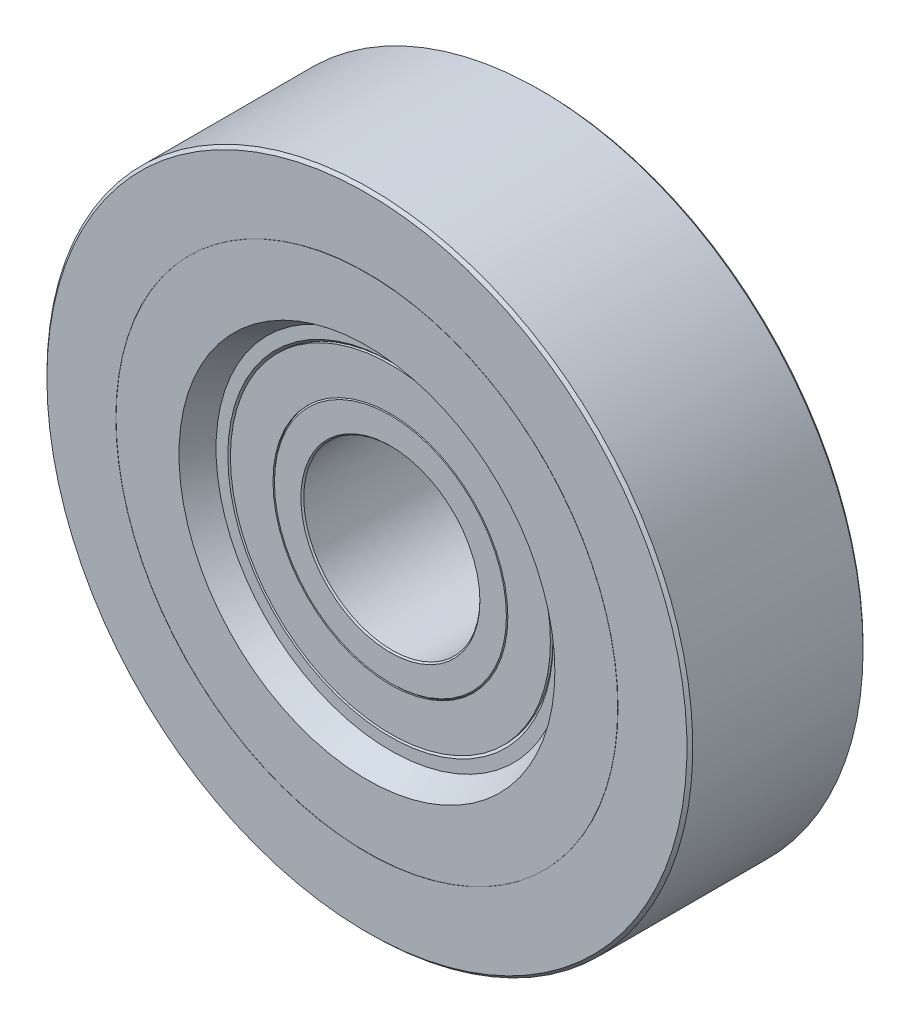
ISO-10303-21;
HEADER;
FILE_DESCRIPTION(('STEP AP214'),'2;1');
FILE_NAME('part.step','',(''),(''),'','','');
FILE_SCHEMA(('AUTOMOTIVE_DESIGN { 1 0 10303 214 1 1 1 1 }'));
ENDSEC;
DATA;
#1=APPLICATION_CONTEXT('core data for automotive mechanical design processes');
#2=APPLICATION_PROTOCOL_DEFINITION('international standard','automotive_design',2000,#1);
#3=PRODUCT_CONTEXT('',#1,'mechanical');
#4=PRODUCT('Part','Part','',(#3));
#5=PRODUCT_RELATED_PRODUCT_CATEGORY('part','',(#4));
#6=PRODUCT_DEFINITION_FORMATION('','',#4);
#7=PRODUCT_DEFINITION_CONTEXT('part definition',#1,'design');
#8=PRODUCT_DEFINITION('design','',#6,#7);
#9=PRODUCT_DEFINITION_SHAPE('','',#8);
#10=(LENGTH_UNIT() NAMED_UNIT(*) SI_UNIT(.MILLI.,.METRE.));
#11=(NAMED_UNIT(*) PLANE_ANGLE_UNIT() SI_UNIT($,.RADIAN.));
#12=(NAMED_UNIT(*) SI_UNIT($,.STERADIAN.) SOLID_ANGLE_UNIT());
#13=UNCERTAINTY_MEASURE_WITH_UNIT(LENGTH_MEASURE(1.E-05),#10,'distance_accuracy_value','');
#14=(GEOMETRIC_REPRESENTATION_CONTEXT(3) GLOBAL_UNCERTAINTY_ASSIGNED_CONTEXT((#13)) GLOBAL_UNIT_ASSIGNED_CONTEXT((#10,
#11,#12)) REPRESENTATION_CONTEXT('',''));
#15=CARTESIAN_POINT('',(0.,0.,0.));
#16=DIRECTION('',(0.,0.,1.));
#17=DIRECTION('',(1.,0.,0.));
#18=AXIS2_PLACEMENT_3D('',#15,#16,#17);
#19=CARTESIAN_POINT('',(0.,0.,4.95));
#20=DIRECTION('',(0.,0.,-1.));
#21=DIRECTION('',(-1.,0.,0.));
#22=AXIS2_PLACEMENT_3D('',#19,#20,#21);
#23=CYLINDRICAL_SURFACE('',#22,10.);
#24=CARTESIAN_POINT('',(0.,0.,5.37730061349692));
#25=DIRECTION('',(0.,0.,-1.));
#26=DIRECTION('',(0.,1.,0.));
#27=AXIS2_PLACEMENT_3D('',#24,#25,#26);
#28=CIRCLE('',#27,10.);
#29=CARTESIAN_POINT('',(0.,10.,5.37730061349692));
#30=VERTEX_POINT('',#29);
#31=EDGE_CURVE('E32',#30,#30,#28,.F.);
#32=ORIENTED_EDGE('',*,*,#31,.F.);
#33=EDGE_LOOP('',(#32));
#34=FACE_BOUND('',#33,.T.);
#35=CARTESIAN_POINT('',(0.,0.,5.5));
#36=DIRECTION('',(0.,0.,-1.));
#37=DIRECTION('',(-1.,0.,0.));
#38=AXIS2_PLACEMENT_3D('',#35,#36,#37);
#39=CIRCLE('',#38,10.);
#40=CARTESIAN_POINT('',(-10.,0.,5.5));
#41=VERTEX_POINT('',#40);
#42=EDGE_CURVE('E46',#41,#41,#39,.T.);
#43=ORIENTED_EDGE('',*,*,#42,.F.);
#44=EDGE_LOOP('',(#43));
#45=FACE_BOUND('',#44,.T.);
#46=ADVANCED_FACE('F12',(#34,#45),#23,.F.);
#47=CARTESIAN_POINT('',(0.,11.8125,5.5));
#48=DIRECTION('',(0.,0.,1.));
#49=DIRECTION('',(1.,0.,0.));
#50=AXIS2_PLACEMENT_3D('',#47,#48,#49);
#51=PLANE('',#50);
#52=CARTESIAN_POINT('',(0.,0.,5.5));
#53=DIRECTION('',(0.,0.,-1.));
#54=DIRECTION('',(-1.,0.,0.));
#55=AXIS2_PLACEMENT_3D('',#52,#53,#54);
#56=CIRCLE('',#55,13.625);
#57=CARTESIAN_POINT('',(-13.625,0.,5.5));
#58=VERTEX_POINT('',#57);
#59=EDGE_CURVE('E49',#58,#58,#56,.T.);
#60=ORIENTED_EDGE('',*,*,#59,.F.);
#61=EDGE_LOOP('',(#60));
#62=FACE_BOUND('',#61,.T.);
#63=ORIENTED_EDGE('',*,*,#42,.T.);
#64=EDGE_LOOP('',(#63));
#65=FACE_BOUND('',#64,.T.);
#66=ADVANCED_FACE('F169',(#62,#65),#51,.T.);
#67=CARTESIAN_POINT('',(0.,0.,4.95));
#68=DIRECTION('',(0.,0.,-1.));
#69=DIRECTION('',(-1.,0.,0.));
#70=AXIS2_PLACEMENT_3D('',#67,#68,#69);
#71=CYLINDRICAL_SURFACE('',#70,13.625);
#72=ORIENTED_EDGE('',*,*,#59,.T.);
#73=EDGE_LOOP('',(#72));
#74=FACE_BOUND('',#73,.T.);
#75=CARTESIAN_POINT('',(0.,0.,5.28));
#76=DIRECTION('',(0.,0.,1.));
#77=DIRECTION('',(0.,1.,0.));
#78=AXIS2_PLACEMENT_3D('',#75,#76,#77);
#79=CIRCLE('',#78,13.625);
#80=CARTESIAN_POINT('',(0.,13.625,5.28));
#81=VERTEX_POINT('',#80);
#82=EDGE_CURVE('E35',#81,#81,#79,.T.);
#83=ORIENTED_EDGE('',*,*,#82,.T.);
#84=EDGE_LOOP('',(#83));
#85=FACE_BOUND('',#84,.T.);
#86=ADVANCED_FACE('F171',(#74,#85),#71,.T.);
#87=CARTESIAN_POINT('',(0.,0.,5.5));
#88=DIRECTION('',(0.,0.,1.));
#89=DIRECTION('',(1.,0.,0.));
#90=AXIS2_PLACEMENT_3D('',#87,#88,#89);
#91=CONICAL_SURFACE('',#90,13.845,0.785398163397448);
#92=ORIENTED_EDGE('',*,*,#82,.F.);
#93=EDGE_LOOP('',(#92));
#94=FACE_BOUND('',#93,.T.);
#95=CARTESIAN_POINT('',(0.,0.,5.5));
#96=DIRECTION('',(0.,0.,1.));
#97=DIRECTION('',(1.,0.,0.));
#98=AXIS2_PLACEMENT_3D('',#95,#96,#97);
#99=CIRCLE('',#98,13.845);
#100=CARTESIAN_POINT('',(13.845,0.,5.5));
#101=VERTEX_POINT('',#100);
#102=EDGE_CURVE('E62',#101,#101,#99,.F.);
#103=ORIENTED_EDGE('',*,*,#102,.F.);
#104=EDGE_LOOP('',(#103));
#105=FACE_BOUND('',#104,.T.);
#106=ADVANCED_FACE('F174',(#94,#105),#91,.F.);
#107=CARTESIAN_POINT('',(0.,14.3475,5.5));
#108=DIRECTION('',(0.,0.,1.));
#109=DIRECTION('',(1.,0.,0.));
#110=AXIS2_PLACEMENT_3D('',#107,#108,#109);
#111=PLANE('',#110);
#112=CARTESIAN_POINT('',(0.,0.,5.5));
#113=DIRECTION('',(0.,0.,1.));
#114=DIRECTION('',(1.,0.,0.));
#115=AXIS2_PLACEMENT_3D('',#112,#113,#114);
#116=CIRCLE('',#115,14.85);
#117=CARTESIAN_POINT('',(14.85,0.,5.5));
#118=VERTEX_POINT('',#117);
#119=EDGE_CURVE('E104',#118,#118,#116,.T.);
#120=ORIENTED_EDGE('',*,*,#119,.T.);
#121=EDGE_LOOP('',(#120));
#122=FACE_BOUND('',#121,.T.);
#123=ORIENTED_EDGE('',*,*,#102,.T.);
#124=EDGE_LOOP('',(#123));
#125=FACE_BOUND('',#124,.T.);
#126=ADVANCED_FACE('F237',(#122,#125),#111,.T.);
#127=CARTESIAN_POINT('',(0.,0.,7.5));
#128=DIRECTION('',(0.,0.,1.));
#129=DIRECTION('',(1.,0.,0.));
#130=AXIS2_PLACEMENT_3D('',#127,#128,#129);
#131=CONICAL_SURFACE('',#130,16.0047005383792,0.523598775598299);
#132=ORIENTED_EDGE('',*,*,#119,.F.);
#133=EDGE_LOOP('',(#132));
#134=FACE_BOUND('',#133,.T.);
#135=CARTESIAN_POINT('',(0.,0.,7.5));
#136=DIRECTION('',(0.,0.,1.));
#137=DIRECTION('',(1.,0.,0.));
#138=AXIS2_PLACEMENT_3D('',#135,#136,#137);
#139=CIRCLE('',#138,16.0047005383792);
#140=CARTESIAN_POINT('',(16.0047005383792,0.,7.5));
#141=VERTEX_POINT('',#140);
#142=EDGE_CURVE('E98',#141,#141,#139,.F.);
#143=ORIENTED_EDGE('',*,*,#142,.F.);
#144=EDGE_LOOP('',(#143));
#145=FACE_BOUND('',#144,.T.);
#146=ADVANCED_FACE('F230',(#134,#145),#131,.F.);
#147=CARTESIAN_POINT('',(0.,18.6826002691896,7.5));
#148=DIRECTION('',(0.,0.,1.));
#149=DIRECTION('',(1.,0.,0.));
#150=AXIS2_PLACEMENT_3D('',#147,#148,#149);
#151=PLANE('',#150);
#152=CARTESIAN_POINT('',(0.,0.,7.5));
#153=DIRECTION('',(0.,0.,-1.));
#154=DIRECTION('',(-1.,0.,0.));
#155=AXIS2_PLACEMENT_3D('',#152,#153,#154);
#156=CIRCLE('',#155,21.3605);
#157=CARTESIAN_POINT('',(-21.3605,0.,7.5));
#158=VERTEX_POINT('',#157);
#159=EDGE_CURVE('E92',#158,#158,#156,.T.);
#160=ORIENTED_EDGE('',*,*,#159,.F.);
#161=EDGE_LOOP('',(#160));
#162=FACE_BOUND('',#161,.T.);
#163=ORIENTED_EDGE('',*,*,#142,.T.);
#164=EDGE_LOOP('',(#163));
#165=FACE_BOUND('',#164,.T.);
#166=ADVANCED_FACE('F222',(#162,#165),#151,.T.);
#167=CARTESIAN_POINT('',(0.,0.,7.49));
#168=DIRECTION('',(0.,0.,-1.));
#169=DIRECTION('',(-1.,0.,0.));
#170=AXIS2_PLACEMENT_3D('',#167,#168,#169);
#171=CYLINDRICAL_SURFACE('',#170,21.3605);
#172=ORIENTED_EDGE('',*,*,#159,.T.);
#173=EDGE_LOOP('',(#172));
#174=FACE_BOUND('',#173,.T.);
#175=CARTESIAN_POINT('',(0.,0.,7.48));
#176=DIRECTION('',(0.,0.,-1.));
#177=DIRECTION('',(-1.,0.,0.));
#178=AXIS2_PLACEMENT_3D('',#175,#176,#177);
#179=CIRCLE('',#178,21.3605);
#180=CARTESIAN_POINT('',(-21.3605,0.,7.48));
#181=VERTEX_POINT('',#180);
#182=EDGE_CURVE('E86',#181,#181,#179,.T.);
#183=ORIENTED_EDGE('',*,*,#182,.F.);
#184=EDGE_LOOP('',(#183));
#185=FACE_BOUND('',#184,.T.);
#186=ADVANCED_FACE('F214',(#174,#185),#171,.T.);
#187=CARTESIAN_POINT('',(0.,21.3705,7.48));
#188=DIRECTION('',(0.,0.,1.));
#189=DIRECTION('',(1.,0.,0.));
#190=AXIS2_PLACEMENT_3D('',#187,#188,#189);
#191=PLANE('',#190);
#192=CARTESIAN_POINT('',(0.,0.,7.48));
#193=DIRECTION('',(0.,0.,-1.));
#194=DIRECTION('',(-1.,0.,0.));
#195=AXIS2_PLACEMENT_3D('',#192,#193,#194);
#196=CIRCLE('',#195,21.3805);
#197=CARTESIAN_POINT('',(-21.3805,0.,7.48));
#198=VERTEX_POINT('',#197);
#199=EDGE_CURVE('E80',#198,#198,#196,.F.);
#200=ORIENTED_EDGE('',*,*,#199,.T.);
#201=EDGE_LOOP('',(#200));
#202=FACE_BOUND('',#201,.T.);
#203=ORIENTED_EDGE('',*,*,#182,.T.);
#204=EDGE_LOOP('',(#203));
#205=FACE_BOUND('',#204,.T.);
#206=ADVANCED_FACE('F206',(#202,#205),#191,.T.);
#207=CARTESIAN_POINT('',(0.,0.,7.49));
#208=DIRECTION('',(0.,0.,-1.));
#209=DIRECTION('',(-1.,0.,0.));
#210=AXIS2_PLACEMENT_3D('',#207,#208,#209);
#211=CYLINDRICAL_SURFACE('',#210,21.3805);
#212=ORIENTED_EDGE('',*,*,#199,.F.);
#213=EDGE_LOOP('',(#212));
#214=FACE_BOUND('',#213,.T.);
#215=CARTESIAN_POINT('',(0.,0.,7.5));
#216=DIRECTION('',(0.,0.,-1.));
#217=DIRECTION('',(-1.,0.,0.));
#218=AXIS2_PLACEMENT_3D('',#215,#216,#217);
#219=CIRCLE('',#218,21.3805);
#220=CARTESIAN_POINT('',(-21.3805,0.,7.5));
#221=VERTEX_POINT('',#220);
#222=EDGE_CURVE('E74',#221,#221,#219,.T.);
#223=ORIENTED_EDGE('',*,*,#222,.F.);
#224=EDGE_LOOP('',(#223));
#225=FACE_BOUND('',#224,.T.);
#226=ADVANCED_FACE('F198',(#214,#225),#211,.F.);
#227=CARTESIAN_POINT('',(0.,24.3163761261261,7.5));
#228=DIRECTION('',(0.,0.,1.));
#229=DIRECTION('',(1.,0.,0.));
#230=AXIS2_PLACEMENT_3D('',#227,#228,#229);
#231=PLANE('',#230);
#232=CARTESIAN_POINT('',(0.,0.,7.5));
#233=DIRECTION('',(0.,0.,-1.));
#234=DIRECTION('',(-1.,0.,0.));
#235=AXIS2_PLACEMENT_3D('',#232,#233,#234);
#236=CIRCLE('',#235,27.2522522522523);
#237=CARTESIAN_POINT('',(-27.2522522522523,0.,7.5));
#238=VERTEX_POINT('',#237);
#239=EDGE_CURVE('E68',#238,#238,#236,.T.);
#240=ORIENTED_EDGE('',*,*,#239,.F.);
#241=EDGE_LOOP('',(#240));
#242=FACE_BOUND('',#241,.T.);
#243=ORIENTED_EDGE('',*,*,#222,.T.);
#244=EDGE_LOOP('',(#243));
#245=FACE_BOUND('',#244,.T.);
#246=ADVANCED_FACE('F190',(#242,#245),#231,.T.);
#247=CARTESIAN_POINT('',(0.,0.,7.25225225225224));
#248=DIRECTION('',(0.,0.,-1.));
#249=DIRECTION('',(-1.,0.,0.));
#250=AXIS2_PLACEMENT_3D('',#247,#248,#249);
#251=CONICAL_SURFACE('',#250,27.5,0.785398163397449);
#252=ORIENTED_EDGE('',*,*,#239,.T.);
#253=EDGE_LOOP('',(#252));
#254=FACE_BOUND('',#253,.T.);
#255=CARTESIAN_POINT('',(0.,0.,7.25225225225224));
#256=DIRECTION('',(0.,0.,-1.));
#257=DIRECTION('',(-1.,0.,0.));
#258=AXIS2_PLACEMENT_3D('',#255,#256,#257);
#259=CIRCLE('',#258,27.5);
#260=CARTESIAN_POINT('',(-27.5,0.,7.25225225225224));
#261=VERTEX_POINT('',#260);
#262=EDGE_CURVE('E53',#261,#261,#259,.T.);
#263=ORIENTED_EDGE('',*,*,#262,.F.);
#264=EDGE_LOOP('',(#263));
#265=FACE_BOUND('',#264,.T.);
#266=ADVANCED_FACE('F187',(#254,#265),#251,.T.);
#267=CARTESIAN_POINT('',(0.,0.,-4.95));
#268=DIRECTION('',(0.,0.,-1.));
#269=DIRECTION('',(-1.,0.,0.));
#270=AXIS2_PLACEMENT_3D('',#267,#268,#269);
#271=CYLINDRICAL_SURFACE('',#270,10.);
#272=CARTESIAN_POINT('',(0.,0.,-5.5));
#273=DIRECTION('',(0.,0.,-1.));
#274=DIRECTION('',(-1.,0.,0.));
#275=AXIS2_PLACEMENT_3D('',#272,#273,#274);
#276=CIRCLE('',#275,10.);
#277=CARTESIAN_POINT('',(-10.,0.,-5.5));
#278=VERTEX_POINT('',#277);
#279=EDGE_CURVE('E63',#278,#278,#276,.F.);
#280=ORIENTED_EDGE('',*,*,#279,.F.);
#281=EDGE_LOOP('',(#280));
#282=FACE_BOUND('',#281,.T.);
#283=CARTESIAN_POINT('',(0.,0.,-5.37730061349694));
#284=DIRECTION('',(0.,0.,1.));
#285=DIRECTION('',(0.,1.,0.));
#286=AXIS2_PLACEMENT_3D('',#283,#284,#285);
#287=CIRCLE('',#286,10.);
#288=CARTESIAN_POINT('',(0.,10.,-5.37730061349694));
#289=VERTEX_POINT('',#288);
#290=EDGE_CURVE('E28',#289,#289,#287,.F.);
#291=ORIENTED_EDGE('',*,*,#290,.F.);
#292=EDGE_LOOP('',(#291));
#293=FACE_BOUND('',#292,.T.);
#294=ADVANCED_FACE('F131',(#282,#293),#271,.F.);
#295=CARTESIAN_POINT('',(0.,11.8125,-5.5));
#296=DIRECTION('',(0.,0.,-1.));
#297=DIRECTION('',(-1.,0.,0.));
#298=AXIS2_PLACEMENT_3D('',#295,#296,#297);
#299=PLANE('',#298);
#300=ORIENTED_EDGE('',*,*,#279,.T.);
#301=EDGE_LOOP('',(#300));
#302=FACE_BOUND('',#301,.T.);
#303=CARTESIAN_POINT('',(0.,0.,-5.5));
#304=DIRECTION('',(0.,0.,-1.));
#305=DIRECTION('',(-1.,0.,0.));
#306=AXIS2_PLACEMENT_3D('',#303,#304,#305);
#307=CIRCLE('',#306,13.625);
#308=CARTESIAN_POINT('',(-13.625,0.,-5.5));
#309=VERTEX_POINT('',#308);
#310=EDGE_CURVE('E16',#309,#309,#307,.T.);
#311=ORIENTED_EDGE('',*,*,#310,.T.);
#312=EDGE_LOOP('',(#311));
#313=FACE_BOUND('',#312,.T.);
#314=ADVANCED_FACE('F117',(#302,#313),#299,.T.);
#315=CARTESIAN_POINT('',(0.,0.,-4.95));
#316=DIRECTION('',(0.,0.,-1.));
#317=DIRECTION('',(-1.,0.,0.));
#318=AXIS2_PLACEMENT_3D('',#315,#316,#317);
#319=CYLINDRICAL_SURFACE('',#318,13.625);
#320=CARTESIAN_POINT('',(0.,0.,-5.28));
#321=DIRECTION('',(0.,0.,-1.));
#322=DIRECTION('',(0.,1.,0.));
#323=AXIS2_PLACEMENT_3D('',#320,#321,#322);
#324=CIRCLE('',#323,13.625);
#325=CARTESIAN_POINT('',(0.,13.625,-5.28));
#326=VERTEX_POINT('',#325);
#327=EDGE_CURVE('E59',#326,#326,#324,.T.);
#328=ORIENTED_EDGE('',*,*,#327,.T.);
#329=EDGE_LOOP('',(#328));
#330=FACE_BOUND('',#329,.T.);
#331=ORIENTED_EDGE('',*,*,#310,.F.);
#332=EDGE_LOOP('',(#331));
#333=FACE_BOUND('',#332,.T.);
#334=ADVANCED_FACE('F14',(#330,#333),#319,.T.);
#335=CARTESIAN_POINT('',(0.,0.,-5.5));
#336=DIRECTION('',(0.,0.,-1.));
#337=DIRECTION('',(-1.,0.,0.));
#338=AXIS2_PLACEMENT_3D('',#335,#336,#337);
#339=CONICAL_SURFACE('',#338,13.845,0.785398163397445);
#340=CARTESIAN_POINT('',(0.,0.,-5.5));
#341=DIRECTION('',(0.,0.,-1.));
#342=DIRECTION('',(-1.,0.,0.));
#343=AXIS2_PLACEMENT_3D('',#340,#341,#342);
#344=CIRCLE('',#343,13.845);
#345=CARTESIAN_POINT('',(-13.845,0.,-5.5));
#346=VERTEX_POINT('',#345);
#347=EDGE_CURVE('E107',#346,#346,#344,.F.);
#348=ORIENTED_EDGE('',*,*,#347,.F.);
#349=EDGE_LOOP('',(#348));
#350=FACE_BOUND('',#349,.T.);
#351=ORIENTED_EDGE('',*,*,#327,.F.);
#352=EDGE_LOOP('',(#351));
#353=FACE_BOUND('',#352,.T.);
#354=ADVANCED_FACE('F120',(#350,#353),#339,.F.);
#355=CARTESIAN_POINT('',(0.,14.3475,-5.5));
#356=DIRECTION('',(0.,0.,-1.));
#357=DIRECTION('',(-1.,0.,0.));
#358=AXIS2_PLACEMENT_3D('',#355,#356,#357);
#359=PLANE('',#358);
#360=ORIENTED_EDGE('',*,*,#347,.T.);
#361=EDGE_LOOP('',(#360));
#362=FACE_BOUND('',#361,.T.);
#363=CARTESIAN_POINT('',(0.,0.,-5.5));
#364=DIRECTION('',(0.,0.,-1.));
#365=DIRECTION('',(-1.,0.,0.));
#366=AXIS2_PLACEMENT_3D('',#363,#364,#365);
#367=CIRCLE('',#366,14.85);
#368=CARTESIAN_POINT('',(-14.85,0.,-5.5));
#369=VERTEX_POINT('',#368);
#370=EDGE_CURVE('E101',#369,#369,#367,.T.);
#371=ORIENTED_EDGE('',*,*,#370,.T.);
#372=EDGE_LOOP('',(#371));
#373=FACE_BOUND('',#372,.T.);
#374=ADVANCED_FACE('F128',(#362,#373),#359,.T.);
#375=CARTESIAN_POINT('',(0.,0.,-7.5));
#376=DIRECTION('',(0.,0.,-1.));
#377=DIRECTION('',(-1.,0.,0.));
#378=AXIS2_PLACEMENT_3D('',#375,#376,#377);
#379=CONICAL_SURFACE('',#378,16.0047005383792,0.523598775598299);
#380=CARTESIAN_POINT('',(0.,0.,-7.5));
#381=DIRECTION('',(0.,0.,-1.));
#382=DIRECTION('',(-1.,0.,0.));
#383=AXIS2_PLACEMENT_3D('',#380,#381,#382);
#384=CIRCLE('',#383,16.0047005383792);
#385=CARTESIAN_POINT('',(-16.0047005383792,0.,-7.5));
#386=VERTEX_POINT('',#385);
#387=EDGE_CURVE('E95',#386,#386,#384,.F.);
#388=ORIENTED_EDGE('',*,*,#387,.F.);
#389=EDGE_LOOP('',(#388));
#390=FACE_BOUND('',#389,.T.);
#391=ORIENTED_EDGE('',*,*,#370,.F.);
#392=EDGE_LOOP('',(#391));
#393=FACE_BOUND('',#392,.T.);
#394=ADVANCED_FACE('F226',(#390,#393),#379,.F.);
#395=CARTESIAN_POINT('',(0.,18.6826002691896,-7.5));
#396=DIRECTION('',(0.,0.,-1.));
#397=DIRECTION('',(-1.,0.,0.));
#398=AXIS2_PLACEMENT_3D('',#395,#396,#397);
#399=PLANE('',#398);
#400=ORIENTED_EDGE('',*,*,#387,.T.);
#401=EDGE_LOOP('',(#400));
#402=FACE_BOUND('',#401,.T.);
#403=CARTESIAN_POINT('',(0.,0.,-7.5));
#404=DIRECTION('',(0.,0.,-1.));
#405=DIRECTION('',(-1.,0.,0.));
#406=AXIS2_PLACEMENT_3D('',#403,#404,#405);
#407=CIRCLE('',#406,21.3605);
#408=CARTESIAN_POINT('',(-21.3605,0.,-7.5));
#409=VERTEX_POINT('',#408);
#410=EDGE_CURVE('E89',#409,#409,#407,.F.);
#411=ORIENTED_EDGE('',*,*,#410,.F.);
#412=EDGE_LOOP('',(#411));
#413=FACE_BOUND('',#412,.T.);
#414=ADVANCED_FACE('F218',(#402,#413),#399,.T.);
#415=CARTESIAN_POINT('',(0.,0.,-7.49));
#416=DIRECTION('',(0.,0.,-1.));
#417=DIRECTION('',(-1.,0.,0.));
#418=AXIS2_PLACEMENT_3D('',#415,#416,#417);
#419=CYLINDRICAL_SURFACE('',#418,21.3605);
#420=CARTESIAN_POINT('',(0.,0.,-7.48));
#421=DIRECTION('',(0.,0.,-1.));
#422=DIRECTION('',(-1.,0.,0.));
#423=AXIS2_PLACEMENT_3D('',#420,#421,#422);
#424=CIRCLE('',#423,21.3605);
#425=CARTESIAN_POINT('',(-21.3605,0.,-7.48));
#426=VERTEX_POINT('',#425);
#427=EDGE_CURVE('E83',#426,#426,#424,.F.);
#428=ORIENTED_EDGE('',*,*,#427,.F.);
#429=EDGE_LOOP('',(#428));
#430=FACE_BOUND('',#429,.T.);
#431=ORIENTED_EDGE('',*,*,#410,.T.);
#432=EDGE_LOOP('',(#431));
#433=FACE_BOUND('',#432,.T.);
#434=ADVANCED_FACE('F210',(#430,#433),#419,.T.);
#435=CARTESIAN_POINT('',(0.,21.3705,-7.48));
#436=DIRECTION('',(0.,0.,-1.));
#437=DIRECTION('',(0.,1.,0.));
#438=AXIS2_PLACEMENT_3D('',#435,#436,#437);
#439=PLANE('',#438);
#440=ORIENTED_EDGE('',*,*,#427,.T.);
#441=EDGE_LOOP('',(#440));
#442=FACE_BOUND('',#441,.T.);
#443=CARTESIAN_POINT('',(0.,0.,-7.48));
#444=DIRECTION('',(0.,0.,-1.));
#445=DIRECTION('',(-1.,0.,0.));
#446=AXIS2_PLACEMENT_3D('',#443,#444,#445);
#447=CIRCLE('',#446,21.3805);
#448=CARTESIAN_POINT('',(-21.3805,0.,-7.48));
#449=VERTEX_POINT('',#448);
#450=EDGE_CURVE('E77',#449,#449,#447,.T.);
#451=ORIENTED_EDGE('',*,*,#450,.T.);
#452=EDGE_LOOP('',(#451));
#453=FACE_BOUND('',#452,.T.);
#454=ADVANCED_FACE('F202',(#442,#453),#439,.T.);
#455=CARTESIAN_POINT('',(0.,0.,-7.49));
#456=DIRECTION('',(0.,0.,-1.));
#457=DIRECTION('',(-1.,0.,0.));
#458=AXIS2_PLACEMENT_3D('',#455,#456,#457);
#459=CYLINDRICAL_SURFACE('',#458,21.3805);
#460=CARTESIAN_POINT('',(0.,0.,-7.5));
#461=DIRECTION('',(0.,0.,-1.));
#462=DIRECTION('',(-1.,0.,0.));
#463=AXIS2_PLACEMENT_3D('',#460,#461,#462);
#464=CIRCLE('',#463,21.3805);
#465=CARTESIAN_POINT('',(-21.3805,0.,-7.5));
#466=VERTEX_POINT('',#465);
#467=EDGE_CURVE('E71',#466,#466,#464,.F.);
#468=ORIENTED_EDGE('',*,*,#467,.F.);
#469=EDGE_LOOP('',(#468));
#470=FACE_BOUND('',#469,.T.);
#471=ORIENTED_EDGE('',*,*,#450,.F.);
#472=EDGE_LOOP('',(#471));
#473=FACE_BOUND('',#472,.T.);
#474=ADVANCED_FACE('F194',(#470,#473),#459,.F.);
#475=CARTESIAN_POINT('',(0.,24.3163761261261,-7.5));
#476=DIRECTION('',(0.,0.,-1.));
#477=DIRECTION('',(-1.,0.,0.));
#478=AXIS2_PLACEMENT_3D('',#475,#476,#477);
#479=PLANE('',#478);
#480=ORIENTED_EDGE('',*,*,#467,.T.);
#481=EDGE_LOOP('',(#480));
#482=FACE_BOUND('',#481,.T.);
#483=CARTESIAN_POINT('',(0.,0.,-7.5));
#484=DIRECTION('',(0.,0.,1.));
#485=DIRECTION('',(1.,0.,0.));
#486=AXIS2_PLACEMENT_3D('',#483,#484,#485);
#487=CIRCLE('',#486,27.2522522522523);
#488=CARTESIAN_POINT('',(27.2522522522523,0.,-7.5));
#489=VERTEX_POINT('',#488);
#490=EDGE_CURVE('E56',#489,#489,#487,.T.);
#491=ORIENTED_EDGE('',*,*,#490,.F.);
#492=EDGE_LOOP('',(#491));
#493=FACE_BOUND('',#492,.T.);
#494=ADVANCED_FACE('F185',(#482,#493),#479,.T.);
#495=CARTESIAN_POINT('',(0.,0.,-7.25225225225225));
#496=DIRECTION('',(0.,0.,1.));
#497=DIRECTION('',(1.,0.,0.));
#498=AXIS2_PLACEMENT_3D('',#495,#496,#497);
#499=CONICAL_SURFACE('',#498,27.5,0.785398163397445);
#500=ORIENTED_EDGE('',*,*,#490,.T.);
#501=EDGE_LOOP('',(#500));
#502=FACE_BOUND('',#501,.T.);
#503=CARTESIAN_POINT('',(0.,0.,-7.2522522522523));
#504=DIRECTION('',(0.,0.,-1.));
#505=DIRECTION('',(-1.,0.,0.));
#506=AXIS2_PLACEMENT_3D('',#503,#504,#505);
#507=CIRCLE('',#506,27.5);
#508=CARTESIAN_POINT('',(-27.5,0.,-7.2522522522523));
#509=VERTEX_POINT('',#508);
#510=EDGE_CURVE('E52',#509,#509,#507,.F.);
#511=ORIENTED_EDGE('',*,*,#510,.F.);
#512=EDGE_LOOP('',(#511));
#513=FACE_BOUND('',#512,.T.);
#514=ADVANCED_FACE('F181',(#502,#513),#499,.T.);
#515=CARTESIAN_POINT('',(0.,0.,0.));
#516=DIRECTION('',(0.,0.,-1.));
#517=DIRECTION('',(-1.,0.,0.));
#518=AXIS2_PLACEMENT_3D('',#515,#516,#517);
#519=CYLINDRICAL_SURFACE('',#518,27.5);
#520=ORIENTED_EDGE('',*,*,#262,.T.);
#521=EDGE_LOOP('',(#520));
#522=FACE_BOUND('',#521,.T.);
#523=ORIENTED_EDGE('',*,*,#510,.T.);
#524=EDGE_LOOP('',(#523));
#525=FACE_BOUND('',#524,.T.);
#526=ADVANCED_FACE('F165',(#522,#525),#519,.T.);
#527=CARTESIAN_POINT('',(0.,0.,5.37730061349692));
#528=DIRECTION('',(0.,0.,-1.));
#529=DIRECTION('',(-1.,0.,0.));
#530=AXIS2_PLACEMENT_3D('',#527,#528,#529);
#531=CONICAL_SURFACE('',#530,10.,0.785398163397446);
#532=CARTESIAN_POINT('',(0.,0.,5.5));
#533=DIRECTION('',(0.,0.,-1.));
#534=DIRECTION('',(-1.,0.,0.));
#535=AXIS2_PLACEMENT_3D('',#532,#533,#534);
#536=CIRCLE('',#535,9.87730061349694);
#537=CARTESIAN_POINT('',(-9.87730061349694,0.,5.5));
#538=VERTEX_POINT('',#537);
#539=EDGE_CURVE('E31',#538,#538,#536,.F.);
#540=ORIENTED_EDGE('',*,*,#539,.F.);
#541=EDGE_LOOP('',(#540));
#542=FACE_BOUND('',#541,.T.);
#543=ORIENTED_EDGE('',*,*,#31,.T.);
#544=EDGE_LOOP('',(#543));
#545=FACE_BOUND('',#544,.T.);
#546=ADVANCED_FACE('F158',(#542,#545),#531,.T.);
#547=CARTESIAN_POINT('',(0.,8.75,5.5));
#548=DIRECTION('',(0.,0.,1.));
#549=DIRECTION('',(1.,0.,0.));
#550=AXIS2_PLACEMENT_3D('',#547,#548,#549);
#551=PLANE('',#550);
#552=ORIENTED_EDGE('',*,*,#539,.T.);
#553=EDGE_LOOP('',(#552));
#554=FACE_BOUND('',#553,.T.);
#555=CARTESIAN_POINT('',(0.,0.,5.5));
#556=DIRECTION('',(0.,0.,1.));
#557=DIRECTION('',(1.,0.,0.));
#558=AXIS2_PLACEMENT_3D('',#555,#556,#557);
#559=CIRCLE('',#558,7.62269938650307);
#560=CARTESIAN_POINT('',(7.62269938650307,0.,5.5));
#561=VERTEX_POINT('',#560);
#562=EDGE_CURVE('E38',#561,#561,#559,.F.);
#563=ORIENTED_EDGE('',*,*,#562,.T.);
#564=EDGE_LOOP('',(#563));
#565=FACE_BOUND('',#564,.T.);
#566=ADVANCED_FACE('F151',(#554,#565),#551,.T.);
#567=CARTESIAN_POINT('',(0.,0.,5.5));
#568=DIRECTION('',(0.,0.,1.));
#569=DIRECTION('',(1.,0.,0.));
#570=AXIS2_PLACEMENT_3D('',#567,#568,#569);
#571=CONICAL_SURFACE('',#570,7.62269938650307,0.785398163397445);
#572=CARTESIAN_POINT('',(0.,0.,5.37730061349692));
#573=DIRECTION('',(0.,0.,-1.));
#574=DIRECTION('',(-1.,0.,0.));
#575=AXIS2_PLACEMENT_3D('',#572,#573,#574);
#576=CIRCLE('',#575,7.5);
#577=CARTESIAN_POINT('',(-7.5,0.,5.37730061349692));
#578=VERTEX_POINT('',#577);
#579=EDGE_CURVE('E20',#578,#578,#576,.T.);
#580=ORIENTED_EDGE('',*,*,#579,.T.);
#581=EDGE_LOOP('',(#580));
#582=FACE_BOUND('',#581,.T.);
#583=ORIENTED_EDGE('',*,*,#562,.F.);
#584=EDGE_LOOP('',(#583));
#585=FACE_BOUND('',#584,.T.);
#586=ADVANCED_FACE('F147',(#582,#585),#571,.F.);
#587=CARTESIAN_POINT('',(0.,0.,-5.37730061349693));
#588=DIRECTION('',(0.,0.,1.));
#589=DIRECTION('',(1.,0.,0.));
#590=AXIS2_PLACEMENT_3D('',#587,#588,#589);
#591=CONICAL_SURFACE('',#590,10.,0.785398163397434);
#592=ORIENTED_EDGE('',*,*,#290,.T.);
#593=EDGE_LOOP('',(#592));
#594=FACE_BOUND('',#593,.T.);
#595=CARTESIAN_POINT('',(0.,0.,-5.5));
#596=DIRECTION('',(0.,0.,1.));
#597=DIRECTION('',(1.,0.,0.));
#598=AXIS2_PLACEMENT_3D('',#595,#596,#597);
#599=CIRCLE('',#598,9.87730061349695);
#600=CARTESIAN_POINT('',(9.87730061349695,0.,-5.5));
#601=VERTEX_POINT('',#600);
#602=EDGE_CURVE('E41',#601,#601,#599,.F.);
#603=ORIENTED_EDGE('',*,*,#602,.F.);
#604=EDGE_LOOP('',(#603));
#605=FACE_BOUND('',#604,.T.);
#606=ADVANCED_FACE('F150',(#594,#605),#591,.T.);
#607=CARTESIAN_POINT('',(0.,8.75,-5.5));
#608=DIRECTION('',(0.,0.,-1.));
#609=DIRECTION('',(-1.,0.,0.));
#610=AXIS2_PLACEMENT_3D('',#607,#608,#609);
#611=PLANE('',#610);
#612=CARTESIAN_POINT('',(0.,0.,-5.5));
#613=DIRECTION('',(0.,0.,-1.));
#614=DIRECTION('',(-1.,0.,0.));
#615=AXIS2_PLACEMENT_3D('',#612,#613,#614);
#616=CIRCLE('',#615,7.62269938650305);
#617=CARTESIAN_POINT('',(-7.62269938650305,0.,-5.5));
#618=VERTEX_POINT('',#617);
#619=EDGE_CURVE('E25',#618,#618,#616,.F.);
#620=ORIENTED_EDGE('',*,*,#619,.T.);
#621=EDGE_LOOP('',(#620));
#622=FACE_BOUND('',#621,.T.);
#623=ORIENTED_EDGE('',*,*,#602,.T.);
#624=EDGE_LOOP('',(#623));
#625=FACE_BOUND('',#624,.T.);
#626=ADVANCED_FACE('F142',(#622,#625),#611,.T.);
#627=CARTESIAN_POINT('',(0.,0.,-5.5));
#628=DIRECTION('',(0.,0.,-1.));
#629=DIRECTION('',(-1.,0.,0.));
#630=AXIS2_PLACEMENT_3D('',#627,#628,#629);
#631=CONICAL_SURFACE('',#630,7.62269938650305,0.785398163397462);
#632=ORIENTED_EDGE('',*,*,#619,.F.);
#633=EDGE_LOOP('',(#632));
#634=FACE_BOUND('',#633,.T.);
#635=CARTESIAN_POINT('',(0.,0.,-5.3773006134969));
#636=DIRECTION('',(0.,0.,-1.));
#637=DIRECTION('',(-1.,0.,0.));
#638=AXIS2_PLACEMENT_3D('',#635,#636,#637);
#639=CIRCLE('',#638,7.5);
#640=CARTESIAN_POINT('',(-7.5,0.,-5.3773006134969));
#641=VERTEX_POINT('',#640);
#642=EDGE_CURVE('E8',#641,#641,#639,.F.);
#643=ORIENTED_EDGE('',*,*,#642,.T.);
#644=EDGE_LOOP('',(#643));
#645=FACE_BOUND('',#644,.T.);
#646=ADVANCED_FACE('F135',(#634,#645),#631,.F.);
#647=CARTESIAN_POINT('',(0.,0.,0.));
#648=DIRECTION('',(0.,0.,-1.));
#649=DIRECTION('',(-1.,0.,0.));
#650=AXIS2_PLACEMENT_3D('',#647,#648,#649);
#651=CYLINDRICAL_SURFACE('',#650,7.5);
#652=ORIENTED_EDGE('',*,*,#642,.F.);
#653=EDGE_LOOP('',(#652));
#654=FACE_BOUND('',#653,.T.);
#655=ORIENTED_EDGE('',*,*,#579,.F.);
#656=EDGE_LOOP('',(#655));
#657=FACE_BOUND('',#656,.T.);
#658=ADVANCED_FACE('F133',(#654,#657),#651,.F.);
#659=CLOSED_SHELL('',(#46,#66,#86,#106,#126,#146,#166,#186,#206,#226,#246,#266,#294,#314,#334,
#354,#374,#394,#414,#434,#454,#474,#494,#514,#526,#546,#566,#586,#606,#626,#646,#658));
#660=MANIFOLD_SOLID_BREP('B1',#659);
#661=ADVANCED_BREP_SHAPE_REPRESENTATION('',(#18,#660),#14);
#662=SHAPE_DEFINITION_REPRESENTATION(#9,#661);
ENDSEC;
END-ISO-10303-21;
